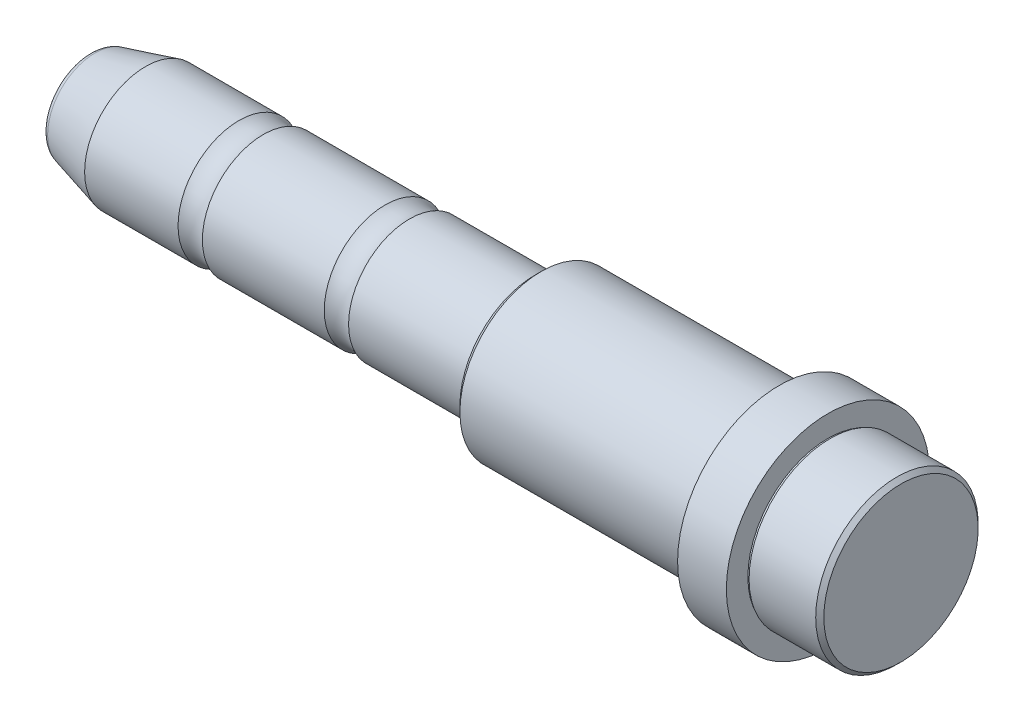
ISO-10303-21;
HEADER;
FILE_DESCRIPTION(('STEP AP214'),'2;1');
FILE_NAME('part.step','',(''),(''),'','','');
FILE_SCHEMA(('AUTOMOTIVE_DESIGN { 1 0 10303 214 1 1 1 1 }'));
ENDSEC;
DATA;
#1=APPLICATION_CONTEXT('core data for automotive mechanical design processes');
#2=APPLICATION_PROTOCOL_DEFINITION('international standard','automotive_design',2000,#1);
#3=PRODUCT_CONTEXT('',#1,'mechanical');
#4=PRODUCT('Part','Part','',(#3));
#5=PRODUCT_RELATED_PRODUCT_CATEGORY('part','',(#4));
#6=PRODUCT_DEFINITION_FORMATION('','',#4);
#7=PRODUCT_DEFINITION_CONTEXT('part definition',#1,'design');
#8=PRODUCT_DEFINITION('design','',#6,#7);
#9=PRODUCT_DEFINITION_SHAPE('','',#8);
#10=(LENGTH_UNIT() NAMED_UNIT(*) SI_UNIT(.MILLI.,.METRE.));
#11=(NAMED_UNIT(*) PLANE_ANGLE_UNIT() SI_UNIT($,.RADIAN.));
#12=(NAMED_UNIT(*) SI_UNIT($,.STERADIAN.) SOLID_ANGLE_UNIT());
#13=UNCERTAINTY_MEASURE_WITH_UNIT(LENGTH_MEASURE(1.E-05),#10,'distance_accuracy_value','');
#14=(GEOMETRIC_REPRESENTATION_CONTEXT(3) GLOBAL_UNCERTAINTY_ASSIGNED_CONTEXT((#13)) GLOBAL_UNIT_ASSIGNED_CONTEXT((#10,
#11,#12)) REPRESENTATION_CONTEXT('',''));
#15=CARTESIAN_POINT('',(0.,0.,0.));
#16=DIRECTION('',(0.,0.,1.));
#17=DIRECTION('',(1.,0.,0.));
#18=AXIS2_PLACEMENT_3D('',#15,#16,#17);
#19=CARTESIAN_POINT('',(91.,0.,0.));
#20=DIRECTION('',(-1.,0.,0.));
#21=DIRECTION('',(0.,0.,1.));
#22=AXIS2_PLACEMENT_3D('',#19,#20,#21);
#23=CYLINDRICAL_SURFACE('',#22,7.5);
#24=CARTESIAN_POINT('',(39.4966629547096,0.,0.));
#25=DIRECTION('',(-1.,0.,0.));
#26=DIRECTION('',(0.,0.,1.));
#27=AXIS2_PLACEMENT_3D('',#24,#25,#26);
#28=CIRCLE('',#27,7.5);
#29=CARTESIAN_POINT('',(39.4966629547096,0.,7.5));
#30=VERTEX_POINT('',#29);
#31=EDGE_CURVE('E18',#30,#30,#28,.T.);
#32=ORIENTED_EDGE('',*,*,#31,.F.);
#33=EDGE_LOOP('',(#32));
#34=FACE_BOUND('',#33,.T.);
#35=CARTESIAN_POINT('',(54.7,0.,0.));
#36=DIRECTION('',(-1.,0.,0.));
#37=DIRECTION('',(0.,0.,1.));
#38=AXIS2_PLACEMENT_3D('',#35,#36,#37);
#39=CIRCLE('',#38,7.5);
#40=CARTESIAN_POINT('',(54.7,0.,7.5));
#41=VERTEX_POINT('',#40);
#42=EDGE_CURVE('E54',#41,#41,#39,.T.);
#43=ORIENTED_EDGE('',*,*,#42,.T.);
#44=EDGE_LOOP('',(#43));
#45=FACE_BOUND('',#44,.T.);
#46=ADVANCED_FACE('F14',(#34,#45),#23,.T.);
#47=CARTESIAN_POINT('',(54.7,7.38750000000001,0.));
#48=DIRECTION('',(-1.,0.,0.));
#49=DIRECTION('',(0.,0.,1.));
#50=AXIS2_PLACEMENT_3D('',#47,#48,#49);
#51=PLANE('',#50);
#52=ORIENTED_EDGE('',*,*,#42,.F.);
#53=EDGE_LOOP('',(#52));
#54=FACE_BOUND('',#53,.T.);
#55=CARTESIAN_POINT('',(54.7,0.,0.));
#56=DIRECTION('',(-1.,0.,0.));
#57=DIRECTION('',(0.,0.,1.));
#58=AXIS2_PLACEMENT_3D('',#55,#56,#57);
#59=CIRCLE('',#58,7.3875);
#60=CARTESIAN_POINT('',(54.7,0.,7.3875));
#61=VERTEX_POINT('',#60);
#62=EDGE_CURVE('E56',#61,#61,#59,.T.);
#63=ORIENTED_EDGE('',*,*,#62,.T.);
#64=EDGE_LOOP('',(#63));
#65=FACE_BOUND('',#64,.T.);
#66=ADVANCED_FACE('F48',(#54,#65),#51,.F.);
#67=CARTESIAN_POINT('',(91.,0.,0.));
#68=DIRECTION('',(-1.,0.,0.));
#69=DIRECTION('',(0.,0.,1.));
#70=AXIS2_PLACEMENT_3D('',#67,#68,#69);
#71=CYLINDRICAL_SURFACE('',#70,7.3875);
#72=CARTESIAN_POINT('',(55.,0.,0.));
#73=DIRECTION('',(-1.,0.,0.));
#74=DIRECTION('',(0.,0.,1.));
#75=AXIS2_PLACEMENT_3D('',#72,#73,#74);
#76=CIRCLE('',#75,7.3875);
#77=CARTESIAN_POINT('',(55.,0.,7.3875));
#78=VERTEX_POINT('',#77);
#79=EDGE_CURVE('E60',#78,#78,#76,.T.);
#80=ORIENTED_EDGE('',*,*,#79,.T.);
#81=EDGE_LOOP('',(#80));
#82=FACE_BOUND('',#81,.T.);
#83=ORIENTED_EDGE('',*,*,#62,.F.);
#84=EDGE_LOOP('',(#83));
#85=FACE_BOUND('',#84,.T.);
#86=ADVANCED_FACE('F161',(#82,#85),#71,.T.);
#87=CARTESIAN_POINT('',(55.,9.3,0.));
#88=DIRECTION('',(1.,0.,0.));
#89=DIRECTION('',(0.,0.,-1.));
#90=AXIS2_PLACEMENT_3D('',#87,#88,#89);
#91=PLANE('',#90);
#92=ORIENTED_EDGE('',*,*,#79,.F.);
#93=EDGE_LOOP('',(#92));
#94=FACE_BOUND('',#93,.T.);
#95=CARTESIAN_POINT('',(55.,0.,0.));
#96=DIRECTION('',(-1.,0.,0.));
#97=DIRECTION('',(0.,0.,1.));
#98=AXIS2_PLACEMENT_3D('',#95,#96,#97);
#99=CIRCLE('',#98,9.3);
#100=CARTESIAN_POINT('',(55.,0.,9.3));
#101=VERTEX_POINT('',#100);
#102=EDGE_CURVE('E65',#101,#101,#99,.T.);
#103=ORIENTED_EDGE('',*,*,#102,.T.);
#104=EDGE_LOOP('',(#103));
#105=FACE_BOUND('',#104,.T.);
#106=ADVANCED_FACE('F157',(#94,#105),#91,.F.);
#107=CARTESIAN_POINT('',(55.7,0.,0.));
#108=DIRECTION('',(1.,0.,0.));
#109=DIRECTION('',(0.,0.,-1.));
#110=AXIS2_PLACEMENT_3D('',#107,#108,#109);
#111=CONICAL_SURFACE('',#110,10.,0.785398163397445);
#112=ORIENTED_EDGE('',*,*,#102,.F.);
#113=EDGE_LOOP('',(#112));
#114=FACE_BOUND('',#113,.T.);
#115=CARTESIAN_POINT('',(55.7,0.,0.));
#116=DIRECTION('',(-1.,0.,0.));
#117=DIRECTION('',(0.,0.,1.));
#118=AXIS2_PLACEMENT_3D('',#115,#116,#117);
#119=CIRCLE('',#118,10.);
#120=CARTESIAN_POINT('',(55.7,0.,10.));
#121=VERTEX_POINT('',#120);
#122=EDGE_CURVE('E68',#121,#121,#119,.T.);
#123=ORIENTED_EDGE('',*,*,#122,.T.);
#124=EDGE_LOOP('',(#123));
#125=FACE_BOUND('',#124,.T.);
#126=ADVANCED_FACE('F153',(#114,#125),#111,.T.);
#127=CARTESIAN_POINT('',(91.,0.,0.));
#128=DIRECTION('',(-1.,0.,0.));
#129=DIRECTION('',(0.,0.,1.));
#130=AXIS2_PLACEMENT_3D('',#127,#128,#129);
#131=CYLINDRICAL_SURFACE('',#130,10.);
#132=ORIENTED_EDGE('',*,*,#122,.F.);
#133=EDGE_LOOP('',(#132));
#134=FACE_BOUND('',#133,.T.);
#135=CARTESIAN_POINT('',(84.7,0.,0.));
#136=DIRECTION('',(-1.,0.,0.));
#137=DIRECTION('',(0.,0.,1.));
#138=AXIS2_PLACEMENT_3D('',#135,#136,#137);
#139=CIRCLE('',#138,10.);
#140=CARTESIAN_POINT('',(84.7,0.,10.));
#141=VERTEX_POINT('',#140);
#142=EDGE_CURVE('E71',#141,#141,#139,.T.);
#143=ORIENTED_EDGE('',*,*,#142,.T.);
#144=EDGE_LOOP('',(#143));
#145=FACE_BOUND('',#144,.T.);
#146=ADVANCED_FACE('F149',(#134,#145),#131,.T.);
#147=CARTESIAN_POINT('',(84.7,9.85,0.));
#148=DIRECTION('',(-1.,0.,0.));
#149=DIRECTION('',(0.,0.,1.));
#150=AXIS2_PLACEMENT_3D('',#147,#148,#149);
#151=PLANE('',#150);
#152=ORIENTED_EDGE('',*,*,#142,.F.);
#153=EDGE_LOOP('',(#152));
#154=FACE_BOUND('',#153,.T.);
#155=CARTESIAN_POINT('',(84.7,0.,0.));
#156=DIRECTION('',(-1.,0.,0.));
#157=DIRECTION('',(0.,0.,1.));
#158=AXIS2_PLACEMENT_3D('',#155,#156,#157);
#159=CIRCLE('',#158,9.85);
#160=CARTESIAN_POINT('',(84.7,0.,9.85));
#161=VERTEX_POINT('',#160);
#162=EDGE_CURVE('E74',#161,#161,#159,.T.);
#163=ORIENTED_EDGE('',*,*,#162,.T.);
#164=EDGE_LOOP('',(#163));
#165=FACE_BOUND('',#164,.T.);
#166=ADVANCED_FACE('F145',(#154,#165),#151,.F.);
#167=CARTESIAN_POINT('',(91.,0.,0.));
#168=DIRECTION('',(-1.,0.,0.));
#169=DIRECTION('',(0.,0.,1.));
#170=AXIS2_PLACEMENT_3D('',#167,#168,#169);
#171=CYLINDRICAL_SURFACE('',#170,9.85);
#172=ORIENTED_EDGE('',*,*,#162,.F.);
#173=EDGE_LOOP('',(#172));
#174=FACE_BOUND('',#173,.T.);
#175=CARTESIAN_POINT('',(85.,0.,0.));
#176=DIRECTION('',(-1.,0.,0.));
#177=DIRECTION('',(0.,0.,1.));
#178=AXIS2_PLACEMENT_3D('',#175,#176,#177);
#179=CIRCLE('',#178,9.85);
#180=CARTESIAN_POINT('',(85.,0.,9.85));
#181=VERTEX_POINT('',#180);
#182=EDGE_CURVE('E77',#181,#181,#179,.T.);
#183=ORIENTED_EDGE('',*,*,#182,.T.);
#184=EDGE_LOOP('',(#183));
#185=FACE_BOUND('',#184,.T.);
#186=ADVANCED_FACE('F141',(#174,#185),#171,.T.);
#187=CARTESIAN_POINT('',(85.,12.5,0.));
#188=DIRECTION('',(1.,0.,0.));
#189=DIRECTION('',(0.,0.,-1.));
#190=AXIS2_PLACEMENT_3D('',#187,#188,#189);
#191=PLANE('',#190);
#192=ORIENTED_EDGE('',*,*,#182,.F.);
#193=EDGE_LOOP('',(#192));
#194=FACE_BOUND('',#193,.T.);
#195=CARTESIAN_POINT('',(85.,0.,0.));
#196=DIRECTION('',(-1.,0.,0.));
#197=DIRECTION('',(0.,0.,1.));
#198=AXIS2_PLACEMENT_3D('',#195,#196,#197);
#199=CIRCLE('',#198,12.5);
#200=CARTESIAN_POINT('',(85.,0.,12.5));
#201=VERTEX_POINT('',#200);
#202=EDGE_CURVE('E80',#201,#201,#199,.T.);
#203=ORIENTED_EDGE('',*,*,#202,.T.);
#204=EDGE_LOOP('',(#203));
#205=FACE_BOUND('',#204,.T.);
#206=ADVANCED_FACE('F137',(#194,#205),#191,.F.);
#207=CARTESIAN_POINT('',(91.,0.,0.));
#208=DIRECTION('',(-1.,0.,0.));
#209=DIRECTION('',(0.,0.,1.));
#210=AXIS2_PLACEMENT_3D('',#207,#208,#209);
#211=CYLINDRICAL_SURFACE('',#210,12.5);
#212=ORIENTED_EDGE('',*,*,#202,.F.);
#213=EDGE_LOOP('',(#212));
#214=FACE_BOUND('',#213,.T.);
#215=CARTESIAN_POINT('',(91.,0.,0.));
#216=DIRECTION('',(-1.,0.,0.));
#217=DIRECTION('',(0.,0.,1.));
#218=AXIS2_PLACEMENT_3D('',#215,#216,#217);
#219=CIRCLE('',#218,12.5);
#220=CARTESIAN_POINT('',(91.,0.,12.5));
#221=VERTEX_POINT('',#220);
#222=EDGE_CURVE('E83',#221,#221,#219,.T.);
#223=ORIENTED_EDGE('',*,*,#222,.T.);
#224=EDGE_LOOP('',(#223));
#225=FACE_BOUND('',#224,.T.);
#226=ADVANCED_FACE('F133',(#214,#225),#211,.T.);
#227=CARTESIAN_POINT('',(91.,12.5,0.));
#228=DIRECTION('',(1.,0.,0.));
#229=DIRECTION('',(0.,0.,-1.));
#230=AXIS2_PLACEMENT_3D('',#227,#228,#229);
#231=PLANE('',#230);
#232=CARTESIAN_POINT('',(91.,0.,0.));
#233=DIRECTION('',(-1.,0.,0.));
#234=DIRECTION('',(0.,0.,1.));
#235=AXIS2_PLACEMENT_3D('',#232,#233,#234);
#236=CIRCLE('',#235,9.85);
#237=CARTESIAN_POINT('',(91.,0.,9.85));
#238=VERTEX_POINT('',#237);
#239=EDGE_CURVE('E86',#238,#238,#236,.T.);
#240=ORIENTED_EDGE('',*,*,#239,.T.);
#241=EDGE_LOOP('',(#240));
#242=FACE_BOUND('',#241,.T.);
#243=ORIENTED_EDGE('',*,*,#222,.F.);
#244=EDGE_LOOP('',(#243));
#245=FACE_BOUND('',#244,.T.);
#246=ADVANCED_FACE('F129',(#242,#245),#231,.T.);
#247=CARTESIAN_POINT('',(91.,0.,0.));
#248=DIRECTION('',(-1.,0.,0.));
#249=DIRECTION('',(0.,0.,1.));
#250=AXIS2_PLACEMENT_3D('',#247,#248,#249);
#251=CYLINDRICAL_SURFACE('',#250,9.85);
#252=CARTESIAN_POINT('',(91.3,0.,0.));
#253=DIRECTION('',(-1.,0.,0.));
#254=DIRECTION('',(0.,0.,1.));
#255=AXIS2_PLACEMENT_3D('',#252,#253,#254);
#256=CIRCLE('',#255,9.85);
#257=CARTESIAN_POINT('',(91.3,0.,9.85));
#258=VERTEX_POINT('',#257);
#259=EDGE_CURVE('E89',#258,#258,#256,.T.);
#260=ORIENTED_EDGE('',*,*,#259,.T.);
#261=EDGE_LOOP('',(#260));
#262=FACE_BOUND('',#261,.T.);
#263=ORIENTED_EDGE('',*,*,#239,.F.);
#264=EDGE_LOOP('',(#263));
#265=FACE_BOUND('',#264,.T.);
#266=ADVANCED_FACE('F125',(#262,#265),#251,.T.);
#267=CARTESIAN_POINT('',(91.3,9.85,0.));
#268=DIRECTION('',(-1.,0.,0.));
#269=DIRECTION('',(0.,0.,1.));
#270=AXIS2_PLACEMENT_3D('',#267,#268,#269);
#271=PLANE('',#270);
#272=CARTESIAN_POINT('',(91.3,0.,0.));
#273=DIRECTION('',(-1.,0.,0.));
#274=DIRECTION('',(0.,0.,1.));
#275=AXIS2_PLACEMENT_3D('',#272,#273,#274);
#276=CIRCLE('',#275,10.);
#277=CARTESIAN_POINT('',(91.3,0.,10.));
#278=VERTEX_POINT('',#277);
#279=EDGE_CURVE('E92',#278,#278,#276,.T.);
#280=ORIENTED_EDGE('',*,*,#279,.T.);
#281=EDGE_LOOP('',(#280));
#282=FACE_BOUND('',#281,.T.);
#283=ORIENTED_EDGE('',*,*,#259,.F.);
#284=EDGE_LOOP('',(#283));
#285=FACE_BOUND('',#284,.T.);
#286=ADVANCED_FACE('F121',(#282,#285),#271,.T.);
#287=CARTESIAN_POINT('',(91.,0.,0.));
#288=DIRECTION('',(-1.,0.,0.));
#289=DIRECTION('',(0.,0.,1.));
#290=AXIS2_PLACEMENT_3D('',#287,#288,#289);
#291=CYLINDRICAL_SURFACE('',#290,10.);
#292=ORIENTED_EDGE('',*,*,#279,.F.);
#293=EDGE_LOOP('',(#292));
#294=FACE_BOUND('',#293,.T.);
#295=CARTESIAN_POINT('',(99.5,0.,0.));
#296=DIRECTION('',(-1.,0.,0.));
#297=DIRECTION('',(0.,0.,1.));
#298=AXIS2_PLACEMENT_3D('',#295,#296,#297);
#299=CIRCLE('',#298,10.);
#300=CARTESIAN_POINT('',(99.5,0.,10.));
#301=VERTEX_POINT('',#300);
#302=EDGE_CURVE('E95',#301,#301,#299,.T.);
#303=ORIENTED_EDGE('',*,*,#302,.T.);
#304=EDGE_LOOP('',(#303));
#305=FACE_BOUND('',#304,.T.);
#306=ADVANCED_FACE('F114',(#294,#305),#291,.T.);
#307=CARTESIAN_POINT('',(99.5,0.,0.));
#308=DIRECTION('',(-1.,0.,0.));
#309=DIRECTION('',(0.,0.,1.));
#310=AXIS2_PLACEMENT_3D('',#307,#308,#309);
#311=CONICAL_SURFACE('',#310,10.,0.78539816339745);
#312=CARTESIAN_POINT('',(100.,0.,0.));
#313=DIRECTION('',(-1.,0.,0.));
#314=DIRECTION('',(0.,0.,1.));
#315=AXIS2_PLACEMENT_3D('',#312,#313,#314);
#316=CIRCLE('',#315,9.5);
#317=CARTESIAN_POINT('',(100.,0.,9.5));
#318=VERTEX_POINT('',#317);
#319=EDGE_CURVE('E36',#318,#318,#316,.T.);
#320=ORIENTED_EDGE('',*,*,#319,.T.);
#321=EDGE_LOOP('',(#320));
#322=FACE_BOUND('',#321,.T.);
#323=ORIENTED_EDGE('',*,*,#302,.F.);
#324=EDGE_LOOP('',(#323));
#325=FACE_BOUND('',#324,.T.);
#326=ADVANCED_FACE('F101',(#322,#325),#311,.T.);
#327=CARTESIAN_POINT('',(100.,0.,0.));
#328=DIRECTION('',(-1.,0.,0.));
#329=DIRECTION('',(0.,0.,1.));
#330=AXIS2_PLACEMENT_3D('',#327,#328,#329);
#331=PLANE('',#330);
#332=ORIENTED_EDGE('',*,*,#319,.F.);
#333=EDGE_LOOP('',(#332));
#334=FACE_BOUND('',#333,.T.);
#335=ADVANCED_FACE('F104',(#334),#331,.F.);
#336=CARTESIAN_POINT('',(38.,0.,0.));
#337=DIRECTION('',(1.,0.,0.));
#338=DIRECTION('',(0.,-1.,0.));
#339=AXIS2_PLACEMENT_3D('',#336,#337,#338);
#340=TOROIDAL_SURFACE('',#339,10.1,3.);
#341=ORIENTED_EDGE('',*,*,#31,.T.);
#342=EDGE_LOOP('',(#341));
#343=FACE_BOUND('',#342,.T.);
#344=CARTESIAN_POINT('',(36.5033370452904,0.,0.));
#345=DIRECTION('',(1.,0.,0.));
#346=DIRECTION('',(0.,0.,-1.));
#347=AXIS2_PLACEMENT_3D('',#344,#345,#346);
#348=CIRCLE('',#347,7.5);
#349=CARTESIAN_POINT('',(36.5033370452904,0.,-7.5));
#350=VERTEX_POINT('',#349);
#351=EDGE_CURVE('E37',#350,#350,#348,.T.);
#352=ORIENTED_EDGE('',*,*,#351,.T.);
#353=EDGE_LOOP('',(#352));
#354=FACE_BOUND('',#353,.T.);
#355=ADVANCED_FACE('F44',(#343,#354),#340,.F.);
#356=CARTESIAN_POINT('',(0.,0.,0.));
#357=DIRECTION('',(-1.,0.,0.));
#358=DIRECTION('',(0.,0.,1.));
#359=AXIS2_PLACEMENT_3D('',#356,#357,#358);
#360=PLANE('',#359);
#361=CARTESIAN_POINT('',(0.,0.,0.));
#362=DIRECTION('',(-1.,0.,0.));
#363=DIRECTION('',(0.,0.,1.));
#364=AXIS2_PLACEMENT_3D('',#361,#362,#363);
#365=CIRCLE('',#364,4.81866231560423);
#366=CARTESIAN_POINT('',(0.,0.,4.81866231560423));
#367=VERTEX_POINT('',#366);
#368=EDGE_CURVE('E10',#367,#367,#365,.T.);
#369=ORIENTED_EDGE('',*,*,#368,.T.);
#370=EDGE_LOOP('',(#369));
#371=FACE_BOUND('',#370,.T.);
#372=ADVANCED_FACE('F16',(#371),#360,.T.);
#373=CARTESIAN_POINT('',(1.05,0.,0.));
#374=DIRECTION('',(-1.,0.,0.));
#375=DIRECTION('',(0.,0.,1.));
#376=AXIS2_PLACEMENT_3D('',#373,#374,#375);
#377=TOROIDAL_SURFACE('',#376,4.81866231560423,1.05);
#378=ORIENTED_EDGE('',*,*,#368,.F.);
#379=EDGE_LOOP('',(#378));
#380=FACE_BOUND('',#379,.T.);
#381=CARTESIAN_POINT('',(0.778240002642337,0.,0.));
#382=DIRECTION('',(-1.,0.,0.));
#383=DIRECTION('',(0.,0.,1.));
#384=AXIS2_PLACEMENT_3D('',#381,#382,#383);
#385=CIRCLE('',#384,5.83288443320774);
#386=CARTESIAN_POINT('',(0.778240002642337,0.,5.83288443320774));
#387=VERTEX_POINT('',#386);
#388=EDGE_CURVE('E22',#387,#387,#385,.T.);
#389=ORIENTED_EDGE('',*,*,#388,.T.);
#390=EDGE_LOOP('',(#389));
#391=FACE_BOUND('',#390,.T.);
#392=ADVANCED_FACE('F172',(#380,#391),#377,.T.);
#393=CARTESIAN_POINT('',(0.778240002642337,0.,0.));
#394=DIRECTION('',(1.,0.,0.));
#395=DIRECTION('',(0.,0.,-1.));
#396=AXIS2_PLACEMENT_3D('',#393,#394,#395);
#397=CONICAL_SURFACE('',#396,5.83288443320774,0.26179938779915);
#398=CARTESIAN_POINT('',(7.,0.,0.));
#399=DIRECTION('',(-1.,0.,0.));
#400=DIRECTION('',(0.,0.,1.));
#401=AXIS2_PLACEMENT_3D('',#398,#399,#400);
#402=CIRCLE('',#401,7.5);
#403=CARTESIAN_POINT('',(7.,0.,7.5));
#404=VERTEX_POINT('',#403);
#405=EDGE_CURVE('E27',#404,#404,#402,.T.);
#406=ORIENTED_EDGE('',*,*,#405,.T.);
#407=EDGE_LOOP('',(#406));
#408=FACE_BOUND('',#407,.T.);
#409=ORIENTED_EDGE('',*,*,#388,.F.);
#410=EDGE_LOOP('',(#409));
#411=FACE_BOUND('',#410,.T.);
#412=ADVANCED_FACE('F169',(#408,#411),#397,.T.);
#413=CARTESIAN_POINT('',(18.5033370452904,0.,0.));
#414=DIRECTION('',(1.,0.,0.));
#415=DIRECTION('',(0.,0.,-1.));
#416=AXIS2_PLACEMENT_3D('',#413,#414,#415);
#417=CIRCLE('',#416,7.5);
#418=CARTESIAN_POINT('',(18.5033370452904,0.,-7.5));
#419=VERTEX_POINT('',#418);
#420=EDGE_CURVE('E31',#419,#419,#417,.T.);
#421=ORIENTED_EDGE('',*,*,#420,.F.);
#422=EDGE_LOOP('',(#421));
#423=FACE_BOUND('',#422,.T.);
#424=ORIENTED_EDGE('',*,*,#405,.F.);
#425=EDGE_LOOP('',(#424));
#426=FACE_BOUND('',#425,.T.);
#427=ADVANCED_FACE('F51',(#423,#426),#23,.T.);
#428=CARTESIAN_POINT('',(20.,0.,0.));
#429=DIRECTION('',(1.,0.,0.));
#430=DIRECTION('',(0.,-1.,0.));
#431=AXIS2_PLACEMENT_3D('',#428,#429,#430);
#432=TOROIDAL_SURFACE('',#431,10.1,3.);
#433=CARTESIAN_POINT('',(21.4966629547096,0.,0.));
#434=DIRECTION('',(-1.,0.,0.));
#435=DIRECTION('',(0.,0.,1.));
#436=AXIS2_PLACEMENT_3D('',#433,#434,#435);
#437=CIRCLE('',#436,7.5);
#438=CARTESIAN_POINT('',(21.4966629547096,0.,7.5));
#439=VERTEX_POINT('',#438);
#440=EDGE_CURVE('E34',#439,#439,#437,.T.);
#441=ORIENTED_EDGE('',*,*,#440,.T.);
#442=EDGE_LOOP('',(#441));
#443=FACE_BOUND('',#442,.T.);
#444=ORIENTED_EDGE('',*,*,#420,.T.);
#445=EDGE_LOOP('',(#444));
#446=FACE_BOUND('',#445,.T.);
#447=ADVANCED_FACE('F117',(#443,#446),#432,.F.);
#448=ORIENTED_EDGE('',*,*,#351,.F.);
#449=EDGE_LOOP('',(#448));
#450=FACE_BOUND('',#449,.T.);
#451=ORIENTED_EDGE('',*,*,#440,.F.);
#452=EDGE_LOOP('',(#451));
#453=FACE_BOUND('',#452,.T.);
#454=ADVANCED_FACE('F50',(#450,#453),#23,.T.);
#455=CLOSED_SHELL('',(#46,#66,#86,#106,#126,#146,#166,#186,#206,#226,#246,#266,#286,#306,#326,
#335,#355,#372,#392,#412,#427,#447,#454));
#456=MANIFOLD_SOLID_BREP('B1',#455);
#457=ADVANCED_BREP_SHAPE_REPRESENTATION('',(#18,#456),#14);
#458=SHAPE_DEFINITION_REPRESENTATION(#9,#457);
ENDSEC;
END-ISO-10303-21;
